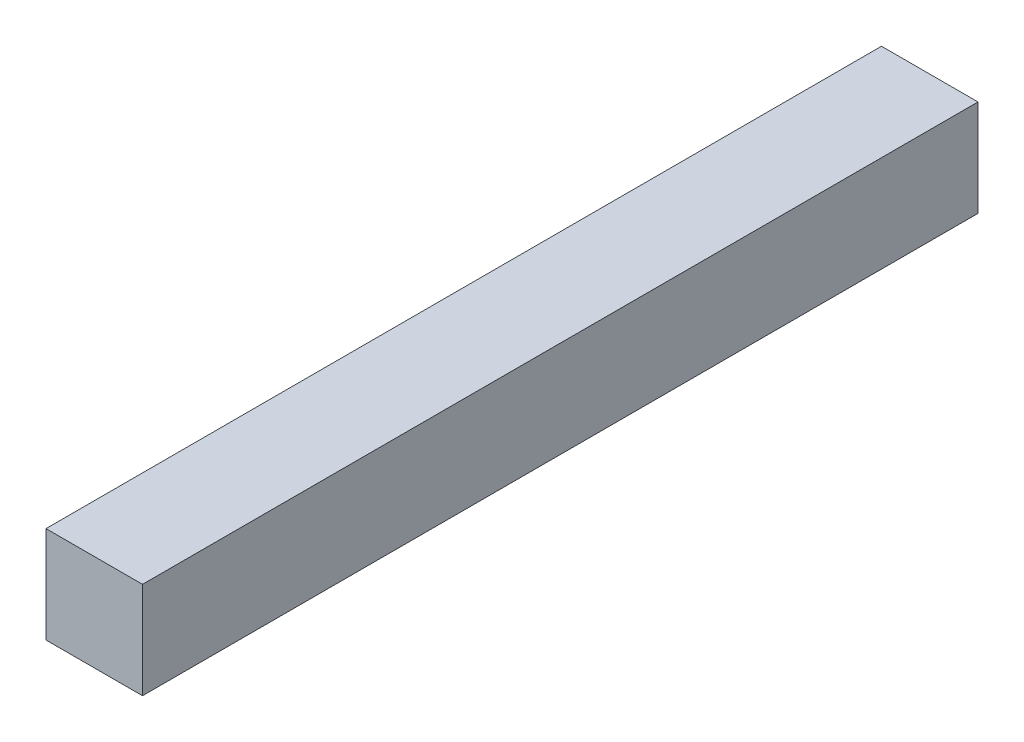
ISO-10303-21;
HEADER;
FILE_DESCRIPTION(('STEP AP214'),'2;1');
FILE_NAME('part.step','',(''),(''),'','','');
FILE_SCHEMA(('AUTOMOTIVE_DESIGN { 1 0 10303 214 1 1 1 1 }'));
ENDSEC;
DATA;
#1=APPLICATION_CONTEXT('core data for automotive mechanical design processes');
#2=APPLICATION_PROTOCOL_DEFINITION('international standard','automotive_design',2000,#1);
#3=PRODUCT_CONTEXT('',#1,'mechanical');
#4=PRODUCT('Part','Part','',(#3));
#5=PRODUCT_RELATED_PRODUCT_CATEGORY('part','',(#4));
#6=PRODUCT_DEFINITION_FORMATION('','',#4);
#7=PRODUCT_DEFINITION_CONTEXT('part definition',#1,'design');
#8=PRODUCT_DEFINITION('design','',#6,#7);
#9=PRODUCT_DEFINITION_SHAPE('','',#8);
#10=(LENGTH_UNIT() NAMED_UNIT(*) SI_UNIT(.MILLI.,.METRE.));
#11=(NAMED_UNIT(*) PLANE_ANGLE_UNIT() SI_UNIT($,.RADIAN.));
#12=(NAMED_UNIT(*) SI_UNIT($,.STERADIAN.) SOLID_ANGLE_UNIT());
#13=UNCERTAINTY_MEASURE_WITH_UNIT(LENGTH_MEASURE(1.E-05),#10,'distance_accuracy_value','');
#14=(GEOMETRIC_REPRESENTATION_CONTEXT(3) GLOBAL_UNCERTAINTY_ASSIGNED_CONTEXT((#13)) GLOBAL_UNIT_ASSIGNED_CONTEXT((#10,
#11,#12)) REPRESENTATION_CONTEXT('',''));
#15=CARTESIAN_POINT('',(0.,0.,0.));
#16=DIRECTION('',(0.,0.,1.));
#17=DIRECTION('',(1.,0.,0.));
#18=AXIS2_PLACEMENT_3D('',#15,#16,#17);
#19=CARTESIAN_POINT('',(33.5,33.5,580.));
#20=DIRECTION('',(-1.,0.,0.));
#21=DIRECTION('',(0.,0.,1.));
#22=AXIS2_PLACEMENT_3D('',#19,#20,#21);
#23=PLANE('',#22);
#24=DIRECTION('',(0.,1.,0.));
#25=VECTOR('',#24,1.);
#26=CARTESIAN_POINT('',(33.5,33.5,0.));
#27=LINE('',#26,#25);
#28=CARTESIAN_POINT('',(33.5,-33.5,0.));
#29=VERTEX_POINT('',#28);
#30=CARTESIAN_POINT('',(33.5,33.5,0.));
#31=VERTEX_POINT('',#30);
#32=EDGE_CURVE('E95',#29,#31,#27,.T.);
#33=ORIENTED_EDGE('',*,*,#32,.T.);
#34=DIRECTION('',(0.,0.,-1.));
#35=VECTOR('',#34,1.);
#36=CARTESIAN_POINT('',(33.5,33.5,580.));
#37=LINE('',#36,#35);
#38=CARTESIAN_POINT('',(33.5,33.5,580.));
#39=VERTEX_POINT('',#38);
#40=EDGE_CURVE('E11',#39,#31,#37,.T.);
#41=ORIENTED_EDGE('',*,*,#40,.F.);
#42=DIRECTION('',(0.,1.,0.));
#43=VECTOR('',#42,1.);
#44=CARTESIAN_POINT('',(33.5,33.5,580.));
#45=LINE('',#44,#43);
#46=CARTESIAN_POINT('',(33.5,-33.5,580.));
#47=VERTEX_POINT('',#46);
#48=EDGE_CURVE('E83',#47,#39,#45,.T.);
#49=ORIENTED_EDGE('',*,*,#48,.F.);
#50=DIRECTION('',(0.,0.,-1.));
#51=VECTOR('',#50,1.);
#52=CARTESIAN_POINT('',(33.5,-33.5,580.));
#53=LINE('',#52,#51);
#54=EDGE_CURVE('E91',#47,#29,#53,.T.);
#55=ORIENTED_EDGE('',*,*,#54,.T.);
#56=EDGE_LOOP('',(#33,#41,#49,#55));
#57=FACE_BOUND('',#56,.T.);
#58=ADVANCED_FACE('F32',(#57),#23,.F.);
#59=CARTESIAN_POINT('',(-33.5,33.5,580.));
#60=DIRECTION('',(0.,-1.,0.));
#61=DIRECTION('',(0.,0.,-1.));
#62=AXIS2_PLACEMENT_3D('',#59,#60,#61);
#63=PLANE('',#62);
#64=DIRECTION('',(-1.,0.,0.));
#65=VECTOR('',#64,1.);
#66=CARTESIAN_POINT('',(-33.5,33.5,0.));
#67=LINE('',#66,#65);
#68=CARTESIAN_POINT('',(-33.5,33.5,0.));
#69=VERTEX_POINT('',#68);
#70=EDGE_CURVE('E87',#31,#69,#67,.T.);
#71=ORIENTED_EDGE('',*,*,#70,.T.);
#72=DIRECTION('',(0.,0.,-1.));
#73=VECTOR('',#72,1.);
#74=CARTESIAN_POINT('',(-33.5,33.5,580.));
#75=LINE('',#74,#73);
#76=CARTESIAN_POINT('',(-33.5,33.5,580.));
#77=VERTEX_POINT('',#76);
#78=EDGE_CURVE('E40',#77,#69,#75,.T.);
#79=ORIENTED_EDGE('',*,*,#78,.F.);
#80=DIRECTION('',(-1.,0.,0.));
#81=VECTOR('',#80,1.);
#82=CARTESIAN_POINT('',(-33.5,33.5,580.));
#83=LINE('',#82,#81);
#84=EDGE_CURVE('E78',#39,#77,#83,.T.);
#85=ORIENTED_EDGE('',*,*,#84,.F.);
#86=ORIENTED_EDGE('',*,*,#40,.T.);
#87=EDGE_LOOP('',(#71,#79,#85,#86));
#88=FACE_BOUND('',#87,.T.);
#89=ADVANCED_FACE('F86',(#88),#63,.F.);
#90=CARTESIAN_POINT('',(-33.5,33.5,580.));
#91=DIRECTION('',(1.,0.,0.));
#92=DIRECTION('',(0.,0.,-1.));
#93=AXIS2_PLACEMENT_3D('',#90,#91,#92);
#94=PLANE('',#93);
#95=DIRECTION('',(0.,-1.,0.));
#96=VECTOR('',#95,1.);
#97=CARTESIAN_POINT('',(-33.5,33.5,0.));
#98=LINE('',#97,#96);
#99=CARTESIAN_POINT('',(-33.5,-33.5,0.));
#100=VERTEX_POINT('',#99);
#101=EDGE_CURVE('E65',#69,#100,#98,.T.);
#102=ORIENTED_EDGE('',*,*,#101,.T.);
#103=DIRECTION('',(0.,0.,-1.));
#104=VECTOR('',#103,1.);
#105=CARTESIAN_POINT('',(-33.5,-33.5,580.));
#106=LINE('',#105,#104);
#107=CARTESIAN_POINT('',(-33.5,-33.5,580.));
#108=VERTEX_POINT('',#107);
#109=EDGE_CURVE('E88',#108,#100,#106,.T.);
#110=ORIENTED_EDGE('',*,*,#109,.F.);
#111=DIRECTION('',(0.,-1.,0.));
#112=VECTOR('',#111,1.);
#113=CARTESIAN_POINT('',(-33.5,33.5,580.));
#114=LINE('',#113,#112);
#115=EDGE_CURVE('E81',#77,#108,#114,.T.);
#116=ORIENTED_EDGE('',*,*,#115,.F.);
#117=ORIENTED_EDGE('',*,*,#78,.T.);
#118=EDGE_LOOP('',(#102,#110,#116,#117));
#119=FACE_BOUND('',#118,.T.);
#120=ADVANCED_FACE('F89',(#119),#94,.F.);
#121=CARTESIAN_POINT('',(-33.5,-33.5,580.));
#122=DIRECTION('',(0.,1.,0.));
#123=DIRECTION('',(0.,0.,1.));
#124=AXIS2_PLACEMENT_3D('',#121,#122,#123);
#125=PLANE('',#124);
#126=DIRECTION('',(1.,0.,0.));
#127=VECTOR('',#126,1.);
#128=CARTESIAN_POINT('',(-33.5,-33.5,0.));
#129=LINE('',#128,#127);
#130=EDGE_CURVE('E71',#100,#29,#129,.T.);
#131=ORIENTED_EDGE('',*,*,#130,.T.);
#132=ORIENTED_EDGE('',*,*,#54,.F.);
#133=DIRECTION('',(1.,0.,0.));
#134=VECTOR('',#133,1.);
#135=CARTESIAN_POINT('',(-33.5,-33.5,580.));
#136=LINE('',#135,#134);
#137=EDGE_CURVE('E48',#108,#47,#136,.T.);
#138=ORIENTED_EDGE('',*,*,#137,.F.);
#139=ORIENTED_EDGE('',*,*,#109,.T.);
#140=EDGE_LOOP('',(#131,#132,#138,#139));
#141=FACE_BOUND('',#140,.T.);
#142=ADVANCED_FACE('F102',(#141),#125,.F.);
#143=CARTESIAN_POINT('',(0.,0.,580.));
#144=DIRECTION('',(0.,0.,1.));
#145=DIRECTION('',(1.,0.,0.));
#146=AXIS2_PLACEMENT_3D('',#143,#144,#145);
#147=PLANE('',#146);
#148=ORIENTED_EDGE('',*,*,#48,.T.);
#149=ORIENTED_EDGE('',*,*,#84,.T.);
#150=ORIENTED_EDGE('',*,*,#115,.T.);
#151=ORIENTED_EDGE('',*,*,#137,.T.);
#152=EDGE_LOOP('',(#148,#149,#150,#151));
#153=FACE_BOUND('',#152,.T.);
#154=ADVANCED_FACE('F79',(#153),#147,.T.);
#155=CARTESIAN_POINT('',(0.,0.,0.));
#156=DIRECTION('',(0.,0.,1.));
#157=DIRECTION('',(1.,0.,0.));
#158=AXIS2_PLACEMENT_3D('',#155,#156,#157);
#159=PLANE('',#158);
#160=ORIENTED_EDGE('',*,*,#32,.F.);
#161=ORIENTED_EDGE('',*,*,#130,.F.);
#162=ORIENTED_EDGE('',*,*,#101,.F.);
#163=ORIENTED_EDGE('',*,*,#70,.F.);
#164=EDGE_LOOP('',(#160,#161,#162,#163));
#165=FACE_BOUND('',#164,.T.);
#166=ADVANCED_FACE('F105',(#165),#159,.F.);
#167=CLOSED_SHELL('',(#58,#89,#120,#142,#154,#166));
#168=MANIFOLD_SOLID_BREP('B2',#167);
#169=ADVANCED_BREP_SHAPE_REPRESENTATION('',(#18,#168),#14);
#170=SHAPE_DEFINITION_REPRESENTATION(#9,#169);
ENDSEC;
END-ISO-10303-21;
